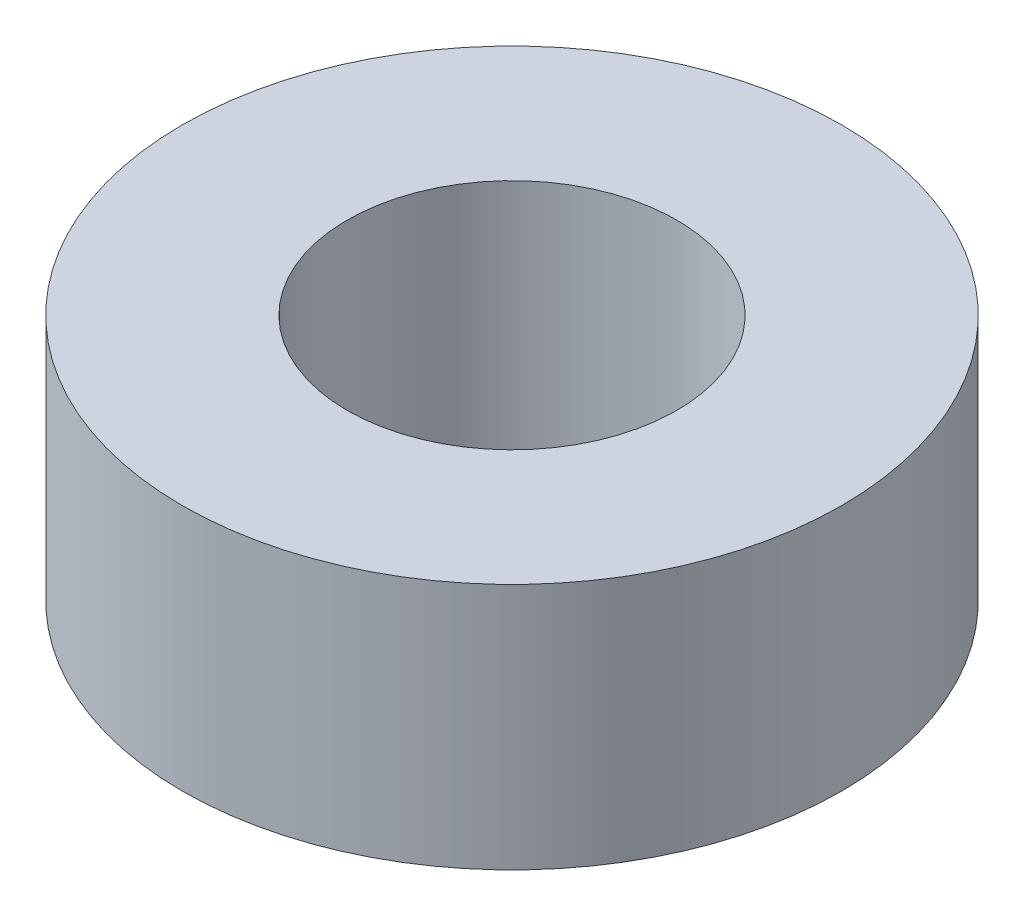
from build123d import *

# Parameters (mm, degrees)
SKETCH1_W = 2
SKETCH1_H = 3


with BuildPart() as part:
    # Sketch1 → Revolve1 (revolve)
    with BuildSketch(Plane.XY, mode=Mode.PRIVATE) as revolve1_sk:
        with Locations((3, 1.5)):
            Rectangle(SKETCH1_W, SKETCH1_H)
    revolve(revolve1_sk.sketch.rotate(Axis((0, 9.22384798, 0), (0, -1, 0)), 90), axis=Axis((0, 9.22384798, 0), (0, -1, 0)))


solid = part.part
